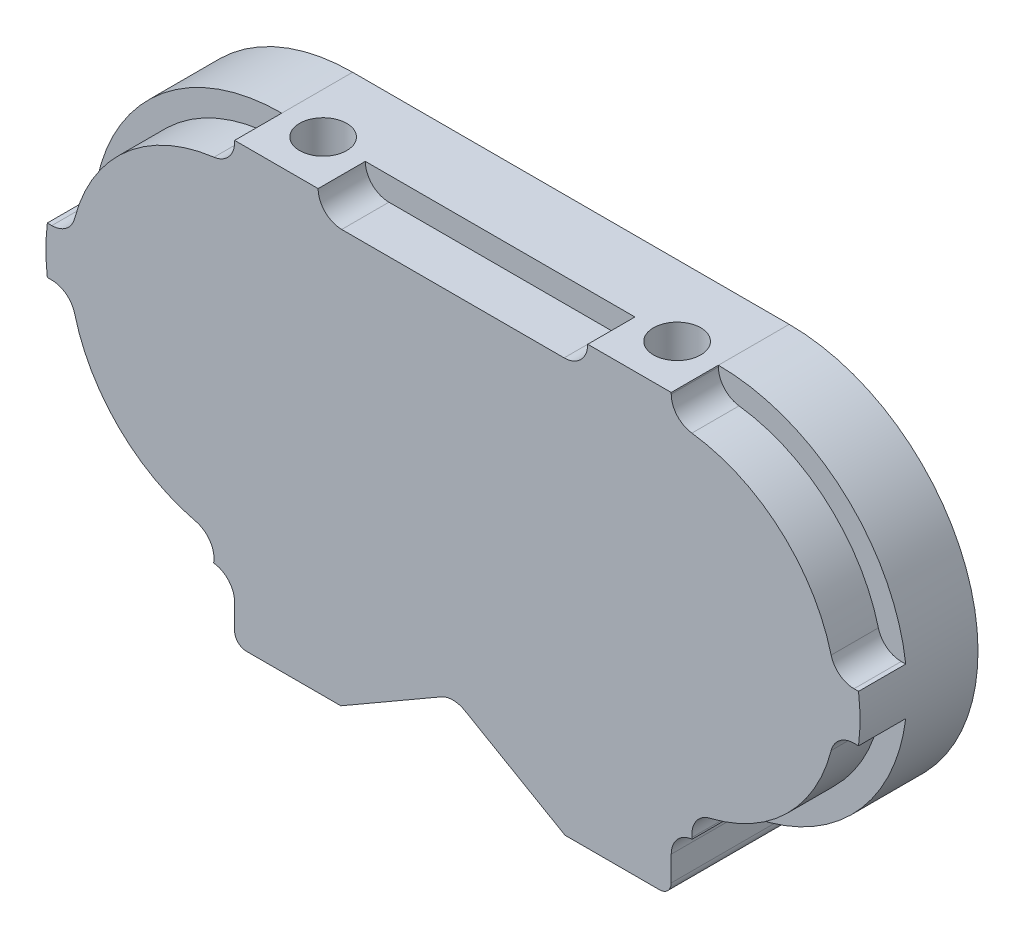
from build123d import *

# Parameters (mm, degrees)
EXTRUDE1_DEPTH  = 20
SKETCH8_R       = 4
EXTRUDE3_DEPTH  = 100
EXTRUDE6_START  = -8
EXTRUDE6_DEPTH  = 8
EXTRUDE9_DEPTH  = 7
SKETCH15_W      = 48
SKETCH15_H      = 36
EXTRUDE10_DEPTH = 14
EXTRUDE12_DEPTH = 6
CHAMFER1_SIZE   = 1.5
CHAMFER2_SIZE   = 1.5
SKETCH17_R      = 3.25
EXTRUDE13_DEPTH = 15


with BuildPart() as part:
    # Sketch1 → Extrude1 (new body)
    with BuildSketch(Plane.XY):
        with BuildLine():
            Line((13, 32), (87, 32))
            ThreePointArc((87, 32), (118.95042552, 1.780536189), (90.555555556, -31.80185568))
            ThreePointArc((90.555555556, -31.80185568), (88.01857603, -33.110420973), (87, -35.77708764))
            Line((87, -35.77708764), (87, -40))
            ThreePointArc((87, -40), (86.414213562, -41.414213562), (85, -42))
            Line((85, -42), (69, -42))
            Line((69, -42), (52, -32.185045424))
            ThreePointArc((52, -32.185045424), (50, -31.649147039), (48, -32.185045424))
            Line((48, -32.185045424), (31, -42))
            Line((31, -42), (15, -42))
            ThreePointArc((15, -42), (13.585786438, -41.414213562), (13, -40))
            Line((13, -40), (13, -35.77708764))
            ThreePointArc((13, -35.77708764), (11.98142397, -33.110420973), (9.444444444, -31.80185568))
            ThreePointArc((9.444444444, -31.80185568), (-18.95042552, 1.780536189), (13, 32))
        make_face()
    extrude(amount=EXTRUDE1_DEPTH)

    # Sketch8 → Extrude3 (cut)
    with BuildSketch(Plane(origin=(0, -42, 0), x_dir=(-1, 0, 0), z_dir=(0, 1, 0))):
        with Locations(Location((-20, 12, 0), (0, 0, 270))):
            Circle(SKETCH8_R)
        with Locations(Location((-80, 12, 0), (0, 0, 270))):
            Circle(SKETCH8_R)
    extrude(amount=EXTRUDE3_DEPTH, mode=Mode.SUBTRACT)

    # Sketch12 → Extrude6 (cut)
    with BuildSketch(Plane.XY.offset(20).offset(EXTRUDE6_START)):
        with BuildLine():
            Line((9.444444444, -31.80185568), (9.472331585, -31.55242551))
            ThreePointArc((9.472331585, -31.55242551), (8.772495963, -28.811945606), (6.434962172, -27.219483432))
            ThreePointArc((6.434962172, -27.219483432), (-6.63985223, -19.95685858), (-14.110883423, -7))
            ThreePointArc((-14.110883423, -7), (-15.534377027, -4.83772234), (-17.98386677, -4))
            Line((-17.98386677, -4), (-18.749015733, -4))
            ThreePointArc((-18.749015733, -4), (-9.468622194, -22.785105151), (9.444444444, -31.80185568))
        make_face()
        with BuildLine():
            Line((68.849086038, 28), (31.150913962, 28))
            ThreePointArc((31.150913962, 28), (28.322486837, 29.171572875), (27.150913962, 32))
            Line((27.150913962, 32), (72.849086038, 32))
            ThreePointArc((72.849086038, 32), (71.677513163, 29.171572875), (68.849086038, 28))
        make_face()
        with BuildLine():
            Line((117.98386677, 4), (118.749015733, 4))
            ThreePointArc((118.749015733, 4), (108.166010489, 24), (87, 32))
            Line((87, 32), (87, 31.749015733))
            ThreePointArc((87, 31.749015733), (88, 29.103264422), (90.5, 27.780388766))
            ThreePointArc((90.5, 27.780388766), (105.498991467, 21.018737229), (114.110883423, 7))
            ThreePointArc((114.110883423, 7), (115.534377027, 4.83772234), (117.98386677, 4))
        make_face()
        with BuildLine():
            Line((-17.98386677, 4), (-18.749015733, 4))
            ThreePointArc((-18.749015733, 4), (-8.166010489, 24), (13, 32))
            Line((13, 32), (13, 31.749015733))
            ThreePointArc((13, 31.749015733), (12, 29.103264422), (9.5, 27.780388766))
            ThreePointArc((9.5, 27.780388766), (-5.498991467, 21.018737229), (-14.110883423, 7))
            ThreePointArc((-14.110883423, 7), (-15.534377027, 4.83772234), (-17.98386677, 4))
        make_face()
        with BuildLine():
            Line((117.98386677, -4), (118.749015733, -4))
            ThreePointArc((118.749015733, -4), (109.468622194, -22.785105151), (90.555555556, -31.80185568))
            Line((90.555555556, -31.80185568), (90.527668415, -31.55242551))
            ThreePointArc((90.527668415, -31.55242551), (91.227504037, -28.811945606), (93.565037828, -27.219483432))
            ThreePointArc((93.565037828, -27.219483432), (106.63985223, -19.95685858), (114.110883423, -7))
            ThreePointArc((114.110883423, -7), (115.534377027, -4.83772234), (117.98386677, -4))
        make_face()
    extrude(amount=EXTRUDE6_DEPTH, mode=Mode.SUBTRACT)

    # Sketch14 → Extrude9 (cut)
    with BuildSketch(Plane(origin=(0, 0, 0), x_dir=(-1, 0, 0), z_dir=(0, 0, -1))):
        with BuildLine():
            Line((-90.325179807, -27.80185568), (-9.674820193, -27.80185568))
            ThreePointArc((-9.674820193, -27.80185568), (14.950420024, 1.665539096), (-13, 28))
            Line((-13, 28), (-87, 28))
            ThreePointArc((-87, 28), (-114.950420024, 1.665539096), (-90.325179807, -27.80185568))
        make_face()
        with BuildLine():
            Line((-89.946029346, -21.80185568), (-10.053970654, -21.80185568))
            ThreePointArc((-10.053970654, -21.80185568), (8.950408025, 1.476342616), (-13, 22))
            Line((-13, 22), (-87, 22))
            ThreePointArc((-87, 22), (-108.950408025, 1.476342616), (-89.946029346, -21.80185568))
        make_face(mode=Mode.SUBTRACT)
    extrude(amount=-EXTRUDE9_DEPTH, mode=Mode.SUBTRACT)

    # Sketch15 → Extrude10 (cut)
    with BuildSketch(Plane(origin=(0, 0, 0), x_dir=(-1, 0, 0), z_dir=(0, 0, -1))):
        with Locations((-50, 0)):
            Rectangle(SKETCH15_W, SKETCH15_H)
    extrude(amount=-EXTRUDE10_DEPTH, mode=Mode.SUBTRACT)

    # Sketch16 → Extrude12 (cut)
    with BuildSketch(Plane(origin=(0, 0, 0), x_dir=(-1, 0, 0), z_dir=(0, 0, -1))):
        with BuildLine():
            Line((-74, 18), (-74, -18))
            ThreePointArc((-74, -18), (-92, 0), (-74, 18))
        make_face()
        with BuildLine():
            Line((-26, -18), (-26, 18))
            ThreePointArc((-26, 18), (-8, 0), (-26, -18))
        make_face()
    extrude(amount=-EXTRUDE12_DEPTH, mode=Mode.SUBTRACT)

    # Chamfer1
    chamfer1_edges = [part.edges().sort_by_distance(p)[0] for p in [
        (50, 28, 0),
        (114.950420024, 1.665539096, 0),
        (-14.950420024, 1.665539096, 0),
    ]]
    chamfer(chamfer1_edges, length=CHAMFER1_SIZE)

    # Chamfer2
    chamfer2_edges = [part.edges().sort_by_distance(p)[0] for p in [
        (50, -27.80185568, 0),
    ]]
    chamfer(chamfer2_edges, length=CHAMFER2_SIZE)

    # Sketch17 → Extrude13 (cut)
    with BuildSketch(Plane(origin=(0, 0, 0), x_dir=(-1, 0, 0), z_dir=(0, 0, -1))):
        with Locations((-100, 0)):
            Circle(SKETCH17_R)
        Circle(SKETCH17_R)
    extrude(amount=-EXTRUDE13_DEPTH, mode=Mode.SUBTRACT)


solid = part.part
